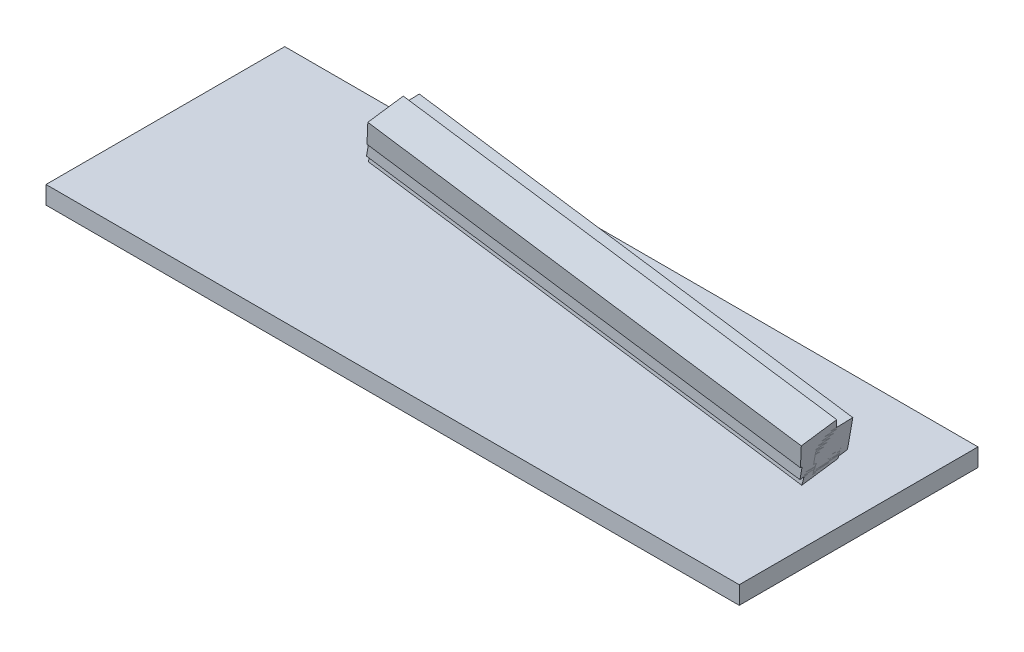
from build123d import *

# Parameters (mm, degrees)
SKETCH3_W                       = 10
SKETCH3_H                       = 10
ONE_CUT_8_DEGREE_POSITIVE_DEPTH = 120
ONE_CUT_8_DEGREE_NEGATIVE_DEPTH = 120
CUT_EXTRUDE1_DEPTH              = 120
CUT_EXTRUDE2_DEPTH              = 120
SKETCH9_W                       = 193.635008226
SKETCH9_H                       = 66.685965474
BOSS_EXTRUDE3_DEPTH             = 5
TWO_CUTS_NEUTRAL_DEPTH          = 120


with BuildPart() as part:
    # Sketch3 → One Cut 8 Degree Positive (new body)
    with BuildSketch(Plane(origin=(-0.982371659, 0.171532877, 0.024107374), x_dir=(-0.17364817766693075, -0.9752236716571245, -0.13705874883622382), z_dir=(-0.984807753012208, 0.17195824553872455, 0.024167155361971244))):
        with Locations((1.315073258, 0.222472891)):
            Rectangle(SKETCH3_W, SKETCH3_H)
    extrude(amount=ONE_CUT_8_DEGREE_POSITIVE_DEPTH)

    # Sketch7 → Cut-Extrude2 (cut)
    with BuildSketch(Plane(origin=(-0.982371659, 0.171532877, 0.024107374), x_dir=(-0.0238069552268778, 0.004156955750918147, -0.9997079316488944), z_dir=(0.984807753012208, -0.17195824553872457, -0.024167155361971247))):
        Polygon((-4.790947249, -3.477526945), (-4.307370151, -6.971437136), (-4.300054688, -3.478555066), align=None)
    extrude(amount=-CUT_EXTRUDE2_DEPTH, mode=Mode.SUBTRACT)


with BuildPart() as body_2:
    # Sketch4 → One Cut 8 Degree Negative (new body)
    with BuildSketch(Plane(origin=(-0.982371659, 0.171532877, 0.024107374), x_dir=(-0.17364817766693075, -0.9752236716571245, -0.13705874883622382), z_dir=(-0.984807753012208, 0.17195824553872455, 0.024167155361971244))):
        Polygon((-1.21863767, 1.882837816), (8.390341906, 4.638168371), (11.070895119, -4.710031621), (1.537735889, -7.729779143), align=None)
    extrude(amount=ONE_CUT_8_DEGREE_NEGATIVE_DEPTH)

    # Sketch5 → Cut-Extrude1 (cut)
    with BuildSketch(Plane(origin=(-0.982371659, 0.171532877, 0.024107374), x_dir=(-0.0238069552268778, 0.004156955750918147, -0.9997079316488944), z_dir=(0.984807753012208, -0.17195824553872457, -0.024167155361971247))):
        Polygon((6.656943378, -7.548965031), (-3.444066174, -8.947002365), (6.183362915, -10.320617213), align=None)
    extrude(amount=-CUT_EXTRUDE1_DEPTH, mode=Mode.SUBTRACT)


with BuildPart() as body_3:
    # Sketch9 → Boss-Extrude3 (new body)
    with BuildSketch(Plane(origin=(0, -10, 0), x_dir=(1, 0, 0), z_dir=(0, 1, 0))):
        with Locations((-85.280960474, -1.565049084)):
            Rectangle(SKETCH9_W, SKETCH9_H)
    extrude(amount=-BOSS_EXTRUDE3_DEPTH)


with BuildPart() as body_4:
    # Sketch8 → Two Cuts Neutral (new body)
    with BuildSketch(Plane(origin=(-0.982371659, 0.171532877, 0.024107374), x_dir=(-0.17364817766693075, -0.9752236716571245, -0.13705874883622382), z_dir=(-0.984807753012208, 0.17195824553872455, 0.024167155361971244))):
        Polygon((7.797820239, 1.877545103), (7.797820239, -8.220730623), (-0.713129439, -9.416866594), (-2.104860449, 0.485814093), (4.675358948, 1.438711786), (5.028864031, 0.64472637), align=None)
    extrude(amount=TWO_CUTS_NEUTRAL_DEPTH)


solid = Compound([part.part, body_2.part, body_3.part, body_4.part])
